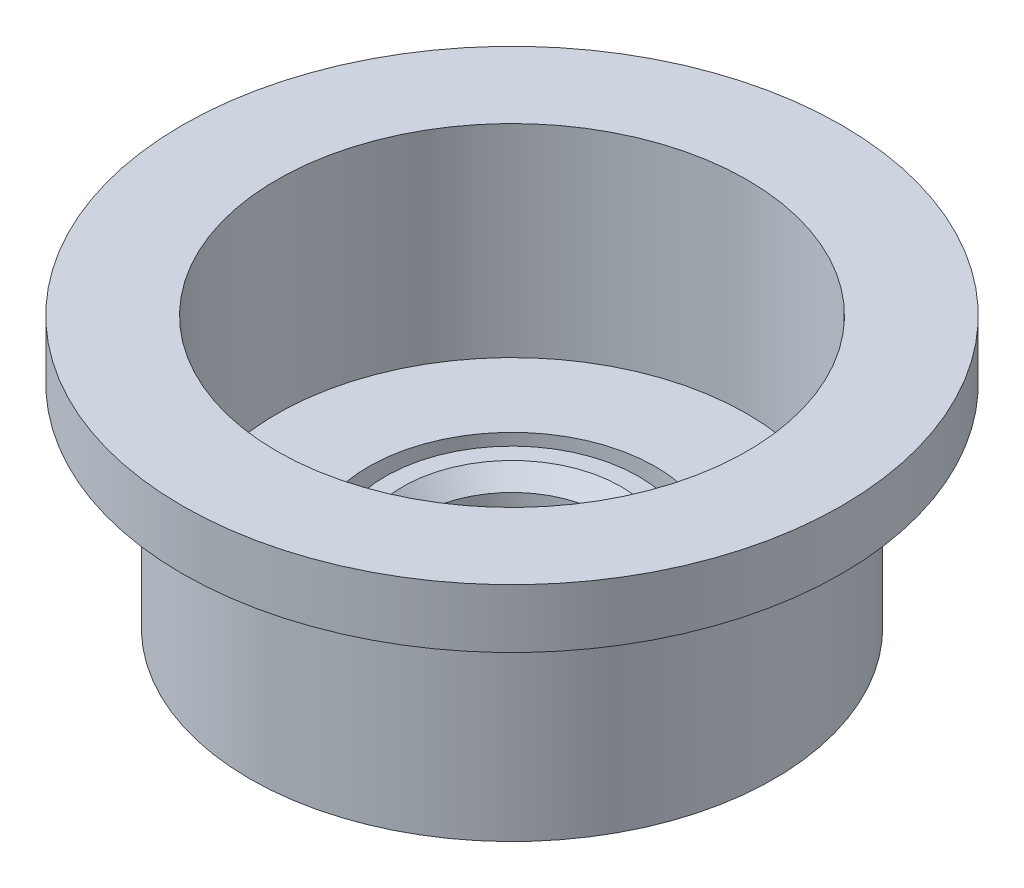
from build123d import *

# Parameters (mm, degrees)
F_3_4_16_TAPPED_HOLE4_D     = 17.4625
F_3_4_16_TAPPED_HOLE4_DEPTH = 25.4
CHAMFER1_SIZE               = 1.524


with BuildPart() as part:
    # Sketch1 → Revolve1 (revolve)
    with BuildSketch(Plane(origin=(0, 0, 0), x_dir=(0, 0, -1), z_dir=(1, 0, 0)), mode=Mode.PRIVATE) as revolve1_sk:
        Polygon((-11.90625, 6.35), (-7.62, 6.35), (-6.35, 4.445), (-6.35, 0), (-24.638, 0), (-24.638, 19.875278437), (-30.988, 19.875278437), (-30.988, 25.4), (-22.098, 25.4), (-22.098, 6.35), (-13.49375, 6.35), (-13.49375, 2.54), (-11.90625, 2.54), align=None)
    revolve(revolve1_sk.sketch.rotate(Axis((0, 0, 0), (0, 1, 0)), 180), axis=Axis((0, 0, 0), (0, 1, 0)))

    # 3_4-16 Tapped Hole4
    with Locations(Plane(origin=(0, 0, 0), x_dir=(-1, 0, 0), z_dir=(0, -1, 0))):
        with Locations((0, 0)):
            Hole(F_3_4_16_TAPPED_HOLE4_D / 2, depth=F_3_4_16_TAPPED_HOLE4_DEPTH)

    # Chamfer1
    chamfer1_edges = [part.edges().sort_by_distance(p)[0] for p in [
        (-8.73125, 6.35, 0),
    ]]
    chamfer(chamfer1_edges, length=CHAMFER1_SIZE)


solid = part.part
